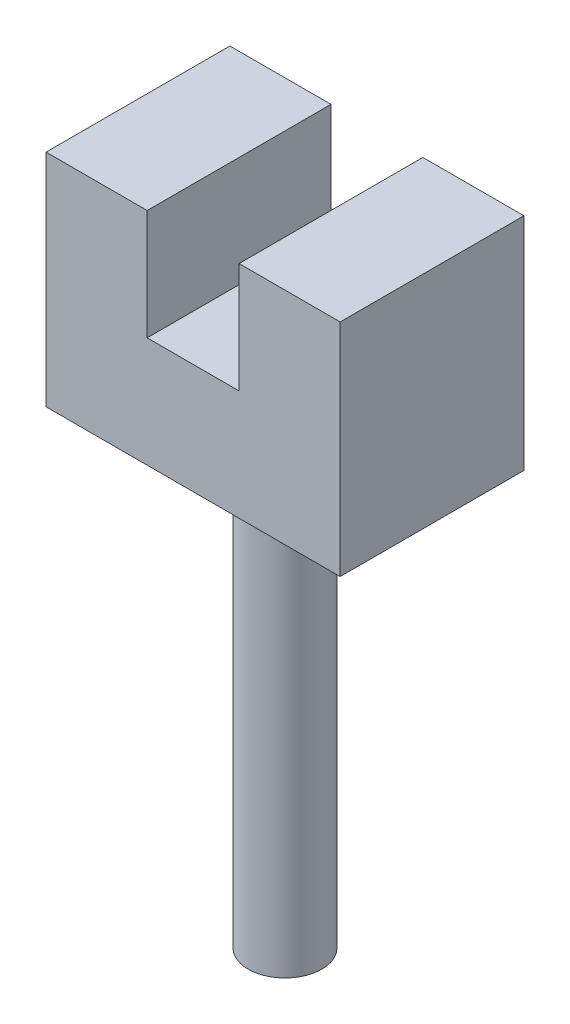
from build123d import *

# Parameters (mm, degrees)
SKETCH1_W           = 15.875
SKETCH1_H           = 31.75
SKETCH1_W_2         = 17.4625
BOSS_EXTRUDE1_DEPTH = 38.1
SKETCH1_4_W         = 15.875
SKETCH1_4_H         = 31.75
CUT_EXTRUDE1_DEPTH  = 19.05
SKETCH2_R           = 6.35
BOSS_EXTRUDE2_DEPTH = 76.2


with BuildPart() as part:
    # Sketch1 → Boss-Extrude1 (new body)
    with BuildSketch(Plane(origin=(0, 0, 0), x_dir=(1, 0, 0), z_dir=(0, 1, 0))):
        with Locations((25.4, 15.875)):
            Rectangle(SKETCH1_W, SKETCH1_H)
        with Locations((8.73125, 15.875)):
            Rectangle(SKETCH1_W_2, SKETCH1_H)
        with Locations((42.06875, 15.875)):
            Rectangle(SKETCH1_W_2, SKETCH1_H)
    extrude(amount=-BOSS_EXTRUDE1_DEPTH)

    # Sketch1_4 → Cut-Extrude1 (cut)
    with BuildSketch(Plane(origin=(0, 0, 0), x_dir=(1, 0, 0), z_dir=(0, 1, 0))):
        with Locations((25.4, 15.875)):
            Rectangle(SKETCH1_4_W, SKETCH1_4_H)
    extrude(amount=-CUT_EXTRUDE1_DEPTH, mode=Mode.SUBTRACT)

    # Sketch2 → Boss-Extrude2 (add)
    with BuildSketch(Plane.XZ.offset(38.1)):
        with Locations(Location((25.4, -15.875, 0), (0, 0, 90))):
            Circle(SKETCH2_R)
    extrude(amount=BOSS_EXTRUDE2_DEPTH)


solid = part.part
